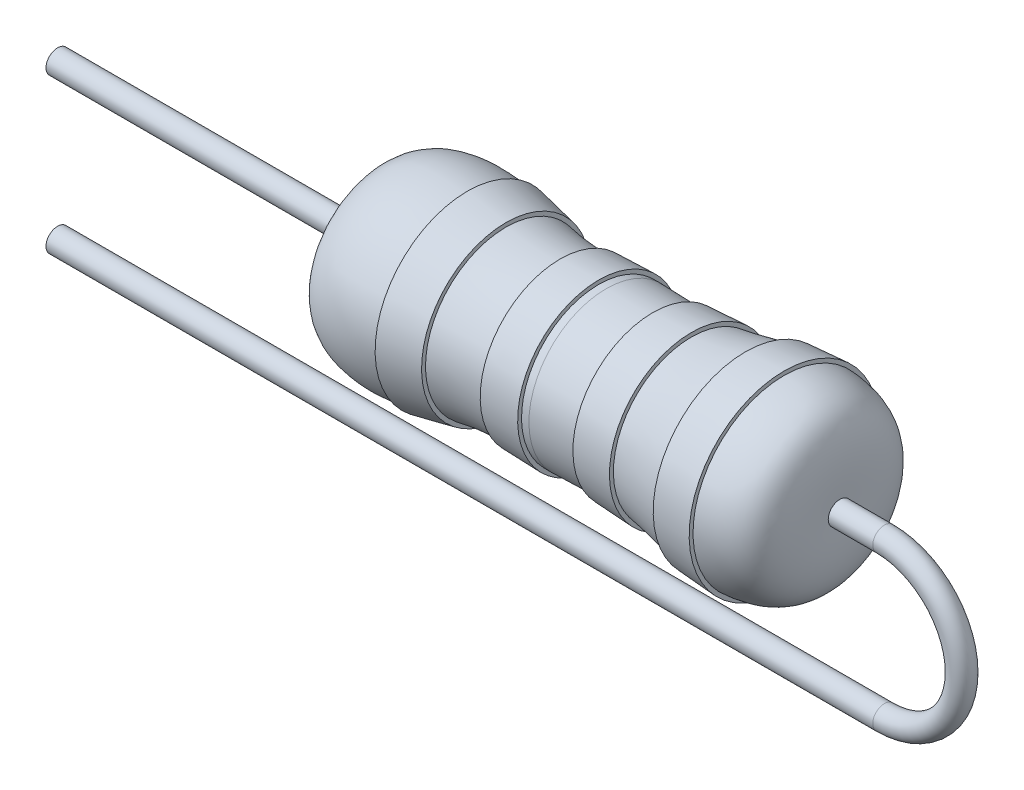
ISO-10303-21;
HEADER;
FILE_DESCRIPTION(('STEP AP214'),'2;1');
FILE_NAME('part.step','',(''),(''),'','','');
FILE_SCHEMA(('AUTOMOTIVE_DESIGN { 1 0 10303 214 1 1 1 1 }'));
ENDSEC;
DATA;
#1=APPLICATION_CONTEXT('core data for automotive mechanical design processes');
#2=APPLICATION_PROTOCOL_DEFINITION('international standard','automotive_design',2000,#1);
#3=PRODUCT_CONTEXT('',#1,'mechanical');
#4=PRODUCT('Part','Part','',(#3));
#5=PRODUCT_RELATED_PRODUCT_CATEGORY('part','',(#4));
#6=PRODUCT_DEFINITION_FORMATION('','',#4);
#7=PRODUCT_DEFINITION_CONTEXT('part definition',#1,'design');
#8=PRODUCT_DEFINITION('design','',#6,#7);
#9=PRODUCT_DEFINITION_SHAPE('','',#8);
#10=(LENGTH_UNIT() NAMED_UNIT(*) SI_UNIT(.MILLI.,.METRE.));
#11=(NAMED_UNIT(*) PLANE_ANGLE_UNIT() SI_UNIT($,.RADIAN.));
#12=(NAMED_UNIT(*) SI_UNIT($,.STERADIAN.) SOLID_ANGLE_UNIT());
#13=UNCERTAINTY_MEASURE_WITH_UNIT(LENGTH_MEASURE(1.E-05),#10,'distance_accuracy_value','');
#14=(GEOMETRIC_REPRESENTATION_CONTEXT(3) GLOBAL_UNCERTAINTY_ASSIGNED_CONTEXT((#13)) GLOBAL_UNIT_ASSIGNED_CONTEXT((#10,
#11,#12)) REPRESENTATION_CONTEXT('',''));
#15=CARTESIAN_POINT('',(0.,0.,0.));
#16=DIRECTION('',(0.,0.,1.));
#17=DIRECTION('',(1.,0.,0.));
#18=AXIS2_PLACEMENT_3D('',#15,#16,#17);
#19=CARTESIAN_POINT('',(-0.597354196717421,0.983703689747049,0.));
#20=CARTESIAN_POINT('',(-0.741393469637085,0.982379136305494,0.));
#21=CARTESIAN_POINT('',(-0.97114945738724,0.986743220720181,0.));
#22=CARTESIAN_POINT('',(-1.21027439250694,1.02468395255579,0.));
#23=CARTESIAN_POINT('',(-1.29735419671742,1.04115266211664,0.));
#24=B_SPLINE_CURVE_WITH_KNOTS('',3,(#19,#20,#21,#22,#23),.UNSPECIFIED.,.F.,.F.,(4,1,4),
(0.15485366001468,0.255892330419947,0.321578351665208),.UNSPECIFIED.);
#25=CARTESIAN_POINT('',(3.1,0.,0.));
#26=DIRECTION('',(1.,0.,0.));
#27=AXIS1_PLACEMENT('',#25,#26);
#28=SURFACE_OF_REVOLUTION('',#24,#27);
#29=CARTESIAN_POINT('',(-1.29735419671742,0.,0.));
#30=DIRECTION('',(1.,0.,0.));
#31=DIRECTION('',(0.,1.,0.));
#32=AXIS2_PLACEMENT_3D('',#29,#30,#31);
#33=CIRCLE('',#32,1.04115266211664);
#34=CARTESIAN_POINT('',(-1.29735419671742,1.04115266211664,0.));
#35=VERTEX_POINT('',#34);
#36=EDGE_CURVE('E10',#35,#35,#33,.T.);
#37=ORIENTED_EDGE('',*,*,#36,.T.);
#38=EDGE_LOOP('',(#37));
#39=FACE_BOUND('',#38,.T.);
#40=CARTESIAN_POINT('',(-0.597354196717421,0.,0.));
#41=DIRECTION('',(1.,0.,0.));
#42=DIRECTION('',(0.,1.,0.));
#43=AXIS2_PLACEMENT_3D('',#40,#41,#42);
#44=CIRCLE('',#43,0.98370368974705);
#45=CARTESIAN_POINT('',(-0.597354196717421,0.983703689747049,0.));
#46=VERTEX_POINT('',#45);
#47=EDGE_CURVE('E90',#46,#46,#44,.T.);
#48=ORIENTED_EDGE('',*,*,#47,.F.);
#49=EDGE_LOOP('',(#48));
#50=FACE_BOUND('',#49,.T.);
#51=ADVANCED_FACE('F28',(#39,#50),#28,.F.);
#52=CARTESIAN_POINT('',(-1.29735419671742,1.09232048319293,0.));
#53=DIRECTION('',(1.,0.,0.));
#54=DIRECTION('',(0.,1.,0.));
#55=AXIS2_PLACEMENT_3D('',#52,#53,#54);
#56=PLANE('',#55);
#57=CARTESIAN_POINT('',(-1.29735419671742,0.,0.));
#58=DIRECTION('',(1.,0.,0.));
#59=DIRECTION('',(0.,1.,0.));
#60=AXIS2_PLACEMENT_3D('',#57,#58,#59);
#61=CIRCLE('',#60,1.09232048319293);
#62=CARTESIAN_POINT('',(-1.29735419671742,1.09232048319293,0.));
#63=VERTEX_POINT('',#62);
#64=EDGE_CURVE('E35',#63,#63,#61,.T.);
#65=ORIENTED_EDGE('',*,*,#64,.T.);
#66=EDGE_LOOP('',(#65));
#67=FACE_BOUND('',#66,.T.);
#68=ORIENTED_EDGE('',*,*,#36,.F.);
#69=EDGE_LOOP('',(#68));
#70=FACE_BOUND('',#69,.T.);
#71=ADVANCED_FACE('F177',(#67,#70),#56,.T.);
#72=CARTESIAN_POINT('',(-1.29735419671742,0.,0.));
#73=DIRECTION('',(-1.,0.,0.));
#74=DIRECTION('',(0.,-1.,0.));
#75=AXIS2_PLACEMENT_3D('',#72,#73,#74);
#76=CONICAL_SURFACE('',#75,1.09232048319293,0.199712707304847);
#77=CARTESIAN_POINT('',(-1.79735419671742,0.,0.));
#78=DIRECTION('',(1.,0.,0.));
#79=DIRECTION('',(0.,1.,0.));
#80=AXIS2_PLACEMENT_3D('',#77,#78,#79);
#81=CIRCLE('',#80,1.1935259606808);
#82=CARTESIAN_POINT('',(-1.79735419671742,1.1935259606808,0.));
#83=VERTEX_POINT('',#82);
#84=EDGE_CURVE('E39',#83,#83,#81,.T.);
#85=ORIENTED_EDGE('',*,*,#84,.T.);
#86=EDGE_LOOP('',(#85));
#87=FACE_BOUND('',#86,.T.);
#88=ORIENTED_EDGE('',*,*,#64,.F.);
#89=EDGE_LOOP('',(#88));
#90=FACE_BOUND('',#89,.T.);
#91=ADVANCED_FACE('F174',(#87,#90),#76,.T.);
#92=CARTESIAN_POINT('',(-1.79735419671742,1.1935259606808,0.));
#93=DIRECTION('',(-1.,0.,0.));
#94=DIRECTION('',(0.,-1.,0.));
#95=AXIS2_PLACEMENT_3D('',#92,#93,#94);
#96=PLANE('',#95);
#97=CARTESIAN_POINT('',(-1.79735419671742,0.,0.));
#98=DIRECTION('',(1.,0.,0.));
#99=DIRECTION('',(0.,1.,0.));
#100=AXIS2_PLACEMENT_3D('',#97,#98,#99);
#101=CIRCLE('',#100,1.14275704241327);
#102=CARTESIAN_POINT('',(-1.79735419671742,1.14275704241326,0.));
#103=VERTEX_POINT('',#102);
#104=EDGE_CURVE('E43',#103,#103,#101,.T.);
#105=ORIENTED_EDGE('',*,*,#104,.T.);
#106=EDGE_LOOP('',(#105));
#107=FACE_BOUND('',#106,.T.);
#108=ORIENTED_EDGE('',*,*,#84,.F.);
#109=EDGE_LOOP('',(#108));
#110=FACE_BOUND('',#109,.T.);
#111=ADVANCED_FACE('F170',(#107,#110),#96,.T.);
#112=CARTESIAN_POINT('',(-1.79735419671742,1.14275704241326,0.));
#113=CARTESIAN_POINT('',(-1.96068782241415,1.17145675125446,0.));
#114=CARTESIAN_POINT('',(-2.31177453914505,1.20993253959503,0.));
#115=CARTESIAN_POINT('',(-3.04069848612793,1.04626137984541,0.));
#116=CARTESIAN_POINT('',(-3.0390580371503,0.470476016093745,0.));
#117=CARTESIAN_POINT('',(-3.02359149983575,0.15,0.));
#118=B_SPLINE_CURVE_WITH_KNOTS('',3,(#112,#113,#114,#115,#116,#117),.UNSPECIFIED.,.F.,.F.,(4,1,
1,4),(0.449746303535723,0.575550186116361,0.717128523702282,0.932875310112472),.UNSPECIFIED.);
#119=CARTESIAN_POINT('',(3.1,0.,0.));
#120=DIRECTION('',(1.,0.,0.));
#121=AXIS1_PLACEMENT('',#119,#120);
#122=SURFACE_OF_REVOLUTION('',#118,#121);
#123=CARTESIAN_POINT('',(-3.02359149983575,0.,0.));
#124=DIRECTION('',(1.,0.,0.));
#125=DIRECTION('',(0.,1.,0.));
#126=AXIS2_PLACEMENT_3D('',#123,#124,#125);
#127=CIRCLE('',#126,0.150000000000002);
#128=CARTESIAN_POINT('',(-3.02359149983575,0.15,0.));
#129=VERTEX_POINT('',#128);
#130=EDGE_CURVE('E48',#129,#129,#127,.T.);
#131=ORIENTED_EDGE('',*,*,#130,.T.);
#132=EDGE_LOOP('',(#131));
#133=FACE_BOUND('',#132,.T.);
#134=ORIENTED_EDGE('',*,*,#104,.F.);
#135=EDGE_LOOP('',(#134));
#136=FACE_BOUND('',#135,.T.);
#137=ADVANCED_FACE('F166',(#133,#136),#122,.F.);
#138=CARTESIAN_POINT('',(3.1,0.,0.));
#139=DIRECTION('',(1.,0.,0.));
#140=DIRECTION('',(0.,1.,0.));
#141=AXIS2_PLACEMENT_3D('',#138,#139,#140);
#142=CYLINDRICAL_SURFACE('',#141,0.150000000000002);
#143=ORIENTED_EDGE('',*,*,#130,.F.);
#144=EDGE_LOOP('',(#143));
#145=FACE_BOUND('',#144,.T.);
#146=CARTESIAN_POINT('',(-7.1,0.,0.));
#147=DIRECTION('',(-1.,0.,0.));
#148=DIRECTION('',(0.,-1.,0.));
#149=AXIS2_PLACEMENT_3D('',#146,#147,#148);
#150=CIRCLE('',#149,0.150000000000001);
#151=CARTESIAN_POINT('',(-7.1,-0.150000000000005,0.));
#152=VERTEX_POINT('',#151);
#153=EDGE_CURVE('E237',#152,#152,#150,.T.);
#154=ORIENTED_EDGE('',*,*,#153,.F.);
#155=EDGE_LOOP('',(#154));
#156=FACE_BOUND('',#155,.T.);
#157=ADVANCED_FACE('F162',(#145,#156),#142,.T.);
#158=CARTESIAN_POINT('',(3.1,0.,0.));
#159=DIRECTION('',(1.,0.,0.));
#160=DIRECTION('',(0.,1.,0.));
#161=AXIS2_PLACEMENT_3D('',#158,#159,#160);
#162=CYLINDRICAL_SURFACE('',#161,0.15);
#163=CARTESIAN_POINT('',(3.02359150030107,0.,0.));
#164=DIRECTION('',(1.,0.,0.));
#165=DIRECTION('',(0.,1.,0.));
#166=AXIS2_PLACEMENT_3D('',#163,#164,#165);
#167=CIRCLE('',#166,0.15);
#168=CARTESIAN_POINT('',(3.02359150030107,0.15,0.));
#169=VERTEX_POINT('',#168);
#170=EDGE_CURVE('E51',#169,#169,#167,.T.);
#171=ORIENTED_EDGE('',*,*,#170,.T.);
#172=EDGE_LOOP('',(#171));
#173=FACE_BOUND('',#172,.T.);
#174=CARTESIAN_POINT('',(3.6,0.,0.));
#175=DIRECTION('',(1.,0.,0.));
#176=DIRECTION('',(0.,0.,-1.));
#177=AXIS2_PLACEMENT_3D('',#174,#175,#176);
#178=CIRCLE('',#177,0.15);
#179=CARTESIAN_POINT('',(3.6,0.15,0.));
#180=VERTEX_POINT('',#179);
#181=EDGE_CURVE('E234',#180,#180,#178,.T.);
#182=ORIENTED_EDGE('',*,*,#181,.F.);
#183=EDGE_LOOP('',(#182));
#184=FACE_BOUND('',#183,.T.);
#185=ADVANCED_FACE('F158',(#173,#184),#162,.T.);
#186=CARTESIAN_POINT('',(3.02359150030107,0.15,0.));
#187=CARTESIAN_POINT('',(3.03906853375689,0.470693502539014,0.));
#188=CARTESIAN_POINT('',(3.04040701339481,1.04615882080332,0.));
#189=CARTESIAN_POINT('',(2.50195996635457,1.16735450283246,0.));
#190=CARTESIAN_POINT('',(2.30264580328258,1.17909283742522,0.));
#191=B_SPLINE_CURVE_WITH_KNOTS('',3,(#186,#187,#188,#189,#190),.UNSPECIFIED.,.F.,.F.,(4,1,4),
(0.575307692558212,0.791200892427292,0.932875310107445),.UNSPECIFIED.);
#192=CARTESIAN_POINT('',(3.1,0.,0.));
#193=DIRECTION('',(1.,0.,0.));
#194=AXIS1_PLACEMENT('',#192,#193);
#195=SURFACE_OF_REVOLUTION('',#191,#194);
#196=CARTESIAN_POINT('',(2.30264580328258,0.,0.));
#197=DIRECTION('',(1.,0.,0.));
#198=DIRECTION('',(0.,1.,0.));
#199=AXIS2_PLACEMENT_3D('',#196,#197,#198);
#200=CIRCLE('',#199,1.17909283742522);
#201=CARTESIAN_POINT('',(2.30264580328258,1.17909283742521,0.));
#202=VERTEX_POINT('',#201);
#203=EDGE_CURVE('E54',#202,#202,#200,.T.);
#204=ORIENTED_EDGE('',*,*,#203,.T.);
#205=EDGE_LOOP('',(#204));
#206=FACE_BOUND('',#205,.T.);
#207=ORIENTED_EDGE('',*,*,#170,.F.);
#208=EDGE_LOOP('',(#207));
#209=FACE_BOUND('',#208,.T.);
#210=ADVANCED_FACE('F153',(#206,#209),#195,.F.);
#211=CARTESIAN_POINT('',(2.30264580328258,1.17909283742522,0.));
#212=DIRECTION('',(1.,0.,0.));
#213=DIRECTION('',(0.,1.,0.));
#214=AXIS2_PLACEMENT_3D('',#211,#212,#213);
#215=PLANE('',#214);
#216=CARTESIAN_POINT('',(2.30264580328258,0.,0.));
#217=DIRECTION('',(1.,0.,0.));
#218=DIRECTION('',(0.,1.,0.));
#219=AXIS2_PLACEMENT_3D('',#216,#217,#218);
#220=CIRCLE('',#219,1.22914772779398);
#221=CARTESIAN_POINT('',(2.30264580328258,1.22914772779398,0.));
#222=VERTEX_POINT('',#221);
#223=EDGE_CURVE('E57',#222,#222,#220,.T.);
#224=ORIENTED_EDGE('',*,*,#223,.T.);
#225=EDGE_LOOP('',(#224));
#226=FACE_BOUND('',#225,.T.);
#227=ORIENTED_EDGE('',*,*,#203,.F.);
#228=EDGE_LOOP('',(#227));
#229=FACE_BOUND('',#228,.T.);
#230=ADVANCED_FACE('F157',(#226,#229),#215,.T.);
#231=CARTESIAN_POINT('',(2.30264580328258,0.,0.));
#232=DIRECTION('',(1.,0.,0.));
#233=DIRECTION('',(0.,1.,0.));
#234=AXIS2_PLACEMENT_3D('',#231,#232,#233);
#235=CONICAL_SURFACE('',#234,1.22914772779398,0.0693079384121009);
#236=CARTESIAN_POINT('',(1.80264580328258,0.,0.));
#237=DIRECTION('',(1.,0.,0.));
#238=DIRECTION('',(0.,1.,0.));
#239=AXIS2_PLACEMENT_3D('',#236,#237,#238);
#240=CIRCLE('',#239,1.19443816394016);
#241=CARTESIAN_POINT('',(1.80264580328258,1.19443816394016,0.));
#242=VERTEX_POINT('',#241);
#243=EDGE_CURVE('E60',#242,#242,#240,.T.);
#244=ORIENTED_EDGE('',*,*,#243,.T.);
#245=EDGE_LOOP('',(#244));
#246=FACE_BOUND('',#245,.T.);
#247=ORIENTED_EDGE('',*,*,#223,.F.);
#248=EDGE_LOOP('',(#247));
#249=FACE_BOUND('',#248,.T.);
#250=ADVANCED_FACE('F219',(#246,#249),#235,.T.);
#251=CARTESIAN_POINT('',(1.80264580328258,1.19443816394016,0.));
#252=DIRECTION('',(-1.,0.,0.));
#253=DIRECTION('',(0.,-1.,0.));
#254=AXIS2_PLACEMENT_3D('',#251,#252,#253);
#255=PLANE('',#254);
#256=CARTESIAN_POINT('',(1.80264580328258,0.,0.));
#257=DIRECTION('',(1.,0.,0.));
#258=DIRECTION('',(0.,1.,0.));
#259=AXIS2_PLACEMENT_3D('',#256,#257,#258);
#260=CIRCLE('',#259,1.14368296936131);
#261=CARTESIAN_POINT('',(1.80264580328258,1.14368296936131,0.));
#262=VERTEX_POINT('',#261);
#263=EDGE_CURVE('E63',#262,#262,#260,.T.);
#264=ORIENTED_EDGE('',*,*,#263,.T.);
#265=EDGE_LOOP('',(#264));
#266=FACE_BOUND('',#265,.T.);
#267=ORIENTED_EDGE('',*,*,#243,.F.);
#268=EDGE_LOOP('',(#267));
#269=FACE_BOUND('',#268,.T.);
#270=ADVANCED_FACE('F132',(#266,#269),#255,.T.);
#271=CARTESIAN_POINT('',(1.80264580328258,1.14368296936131,0.));
#272=CARTESIAN_POINT('',(1.57185221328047,1.10347001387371,0.));
#273=CARTESIAN_POINT('',(1.34646533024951,1.0417378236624,0.));
#274=CARTESIAN_POINT('',(1.10264580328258,1.0093635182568,0.));
#275=B_SPLINE_CURVE_WITH_KNOTS('',3,(#271,#272,#273,#274),.UNSPECIFIED.,.F.,.F.,(4,4),
(0.273403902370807,0.451104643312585),.UNSPECIFIED.);
#276=CARTESIAN_POINT('',(3.1,0.,0.));
#277=DIRECTION('',(1.,0.,0.));
#278=AXIS1_PLACEMENT('',#276,#277);
#279=SURFACE_OF_REVOLUTION('',#275,#278);
#280=CARTESIAN_POINT('',(1.10264580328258,0.,0.));
#281=DIRECTION('',(1.,0.,0.));
#282=DIRECTION('',(0.,1.,0.));
#283=AXIS2_PLACEMENT_3D('',#280,#281,#282);
#284=CIRCLE('',#283,1.0093635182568);
#285=CARTESIAN_POINT('',(1.10264580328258,1.0093635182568,0.));
#286=VERTEX_POINT('',#285);
#287=EDGE_CURVE('E66',#286,#286,#284,.T.);
#288=ORIENTED_EDGE('',*,*,#287,.T.);
#289=EDGE_LOOP('',(#288));
#290=FACE_BOUND('',#289,.T.);
#291=ORIENTED_EDGE('',*,*,#263,.F.);
#292=EDGE_LOOP('',(#291));
#293=FACE_BOUND('',#292,.T.);
#294=ADVANCED_FACE('F128',(#290,#293),#279,.F.);
#295=CARTESIAN_POINT('',(1.10264580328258,1.0605778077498,0.));
#296=DIRECTION('',(1.,0.,0.));
#297=DIRECTION('',(0.,1.,0.));
#298=AXIS2_PLACEMENT_3D('',#295,#296,#297);
#299=PLANE('',#298);
#300=CARTESIAN_POINT('',(1.10264580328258,0.,0.));
#301=DIRECTION('',(1.,0.,0.));
#302=DIRECTION('',(0.,1.,0.));
#303=AXIS2_PLACEMENT_3D('',#300,#301,#302);
#304=CIRCLE('',#303,1.0605778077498);
#305=CARTESIAN_POINT('',(1.10264580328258,1.0605778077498,0.));
#306=VERTEX_POINT('',#305);
#307=EDGE_CURVE('E69',#306,#306,#304,.T.);
#308=ORIENTED_EDGE('',*,*,#307,.T.);
#309=EDGE_LOOP('',(#308));
#310=FACE_BOUND('',#309,.T.);
#311=ORIENTED_EDGE('',*,*,#287,.F.);
#312=EDGE_LOOP('',(#311));
#313=FACE_BOUND('',#312,.T.);
#314=ADVANCED_FACE('F124',(#310,#313),#299,.T.);
#315=CARTESIAN_POINT('',(1.10264580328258,0.,0.));
#316=DIRECTION('',(1.,0.,0.));
#317=DIRECTION('',(0.,1.,0.));
#318=AXIS2_PLACEMENT_3D('',#315,#316,#317);
#319=CONICAL_SURFACE('',#318,1.0605778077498,0.054415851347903);
#320=CARTESIAN_POINT('',(0.60264580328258,0.,0.));
#321=DIRECTION('',(1.,0.,0.));
#322=DIRECTION('',(0.,1.,0.));
#323=AXIS2_PLACEMENT_3D('',#320,#321,#322);
#324=CIRCLE('',#323,1.03334299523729);
#325=CARTESIAN_POINT('',(0.602645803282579,1.03334299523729,0.));
#326=VERTEX_POINT('',#325);
#327=EDGE_CURVE('E72',#326,#326,#324,.T.);
#328=ORIENTED_EDGE('',*,*,#327,.T.);
#329=EDGE_LOOP('',(#328));
#330=FACE_BOUND('',#329,.T.);
#331=ORIENTED_EDGE('',*,*,#307,.F.);
#332=EDGE_LOOP('',(#331));
#333=FACE_BOUND('',#332,.T.);
#334=ADVANCED_FACE('F120',(#330,#333),#319,.T.);
#335=CARTESIAN_POINT('',(0.602645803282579,1.03334299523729,0.));
#336=DIRECTION('',(-1.,0.,0.));
#337=DIRECTION('',(0.,-1.,0.));
#338=AXIS2_PLACEMENT_3D('',#335,#336,#337);
#339=PLANE('',#338);
#340=CARTESIAN_POINT('',(0.60264580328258,0.,0.));
#341=DIRECTION('',(1.,0.,0.));
#342=DIRECTION('',(0.,1.,0.));
#343=AXIS2_PLACEMENT_3D('',#340,#341,#342);
#344=CIRCLE('',#343,0.983657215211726);
#345=CARTESIAN_POINT('',(0.602645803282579,0.983657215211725,0.));
#346=VERTEX_POINT('',#345);
#347=EDGE_CURVE('E75',#346,#346,#344,.T.);
#348=ORIENTED_EDGE('',*,*,#347,.T.);
#349=EDGE_LOOP('',(#348));
#350=FACE_BOUND('',#349,.T.);
#351=ORIENTED_EDGE('',*,*,#327,.F.);
#352=EDGE_LOOP('',(#351));
#353=FACE_BOUND('',#352,.T.);
#354=ADVANCED_FACE('F116',(#350,#353),#339,.T.);
#355=CARTESIAN_POINT('',(0.602645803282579,0.983657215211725,0.));
#356=CARTESIAN_POINT('',(0.379986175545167,0.985520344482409,0.));
#357=CARTESIAN_POINT('',(0.165951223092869,0.999033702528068,0.));
#358=CARTESIAN_POINT('',(0.,1.,0.));
#359=B_SPLINE_CURVE_WITH_KNOTS('',3,(#355,#356,#357,#358),.UNSPECIFIED.,.F.,.F.,(4,4),(0.,
0.156090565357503),.UNSPECIFIED.);
#360=CARTESIAN_POINT('',(3.1,0.,0.));
#361=DIRECTION('',(1.,0.,0.));
#362=AXIS1_PLACEMENT('',#360,#361);
#363=SURFACE_OF_REVOLUTION('',#359,#362);
#364=CARTESIAN_POINT('',(0.,0.,0.));
#365=DIRECTION('',(1.,0.,0.));
#366=DIRECTION('',(0.,1.,0.));
#367=AXIS2_PLACEMENT_3D('',#364,#365,#366);
#368=CIRCLE('',#367,1.);
#369=CARTESIAN_POINT('',(0.,1.,0.));
#370=VERTEX_POINT('',#369);
#371=EDGE_CURVE('E78',#370,#370,#368,.T.);
#372=ORIENTED_EDGE('',*,*,#371,.T.);
#373=EDGE_LOOP('',(#372));
#374=FACE_BOUND('',#373,.T.);
#375=ORIENTED_EDGE('',*,*,#347,.F.);
#376=EDGE_LOOP('',(#375));
#377=FACE_BOUND('',#376,.T.);
#378=ADVANCED_FACE('F111',(#374,#377),#363,.F.);
#379=CARTESIAN_POINT('',(0.,1.,0.));
#380=CARTESIAN_POINT('',(-0.0308720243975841,0.99982023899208,0.));
#381=CARTESIAN_POINT('',(-0.0634081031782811,0.99920625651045,0.));
#382=CARTESIAN_POINT('',(-0.0973541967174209,0.998313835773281,0.));
#383=B_SPLINE_CURVE_WITH_KNOTS('',3,(#379,#380,#381,#382),.UNSPECIFIED.,.F.,.F.,(4,4),(0.,
0.0290376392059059),.UNSPECIFIED.);
#384=CARTESIAN_POINT('',(3.1,0.,0.));
#385=DIRECTION('',(1.,0.,0.));
#386=AXIS1_PLACEMENT('',#384,#385);
#387=SURFACE_OF_REVOLUTION('',#383,#386);
#388=CARTESIAN_POINT('',(-0.0973541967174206,0.,0.));
#389=DIRECTION('',(1.,0.,0.));
#390=DIRECTION('',(0.,1.,0.));
#391=AXIS2_PLACEMENT_3D('',#388,#389,#390);
#392=CIRCLE('',#391,0.998313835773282);
#393=CARTESIAN_POINT('',(-0.097354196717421,0.998313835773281,0.));
#394=VERTEX_POINT('',#393);
#395=EDGE_CURVE('E81',#394,#394,#392,.T.);
#396=ORIENTED_EDGE('',*,*,#395,.T.);
#397=EDGE_LOOP('',(#396));
#398=FACE_BOUND('',#397,.T.);
#399=ORIENTED_EDGE('',*,*,#371,.F.);
#400=EDGE_LOOP('',(#399));
#401=FACE_BOUND('',#400,.T.);
#402=ADVANCED_FACE('F106',(#398,#401),#387,.F.);
#403=CARTESIAN_POINT('',(-0.0973541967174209,1.04852779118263,0.));
#404=DIRECTION('',(1.,0.,0.));
#405=DIRECTION('',(0.,1.,0.));
#406=AXIS2_PLACEMENT_3D('',#403,#404,#405);
#407=PLANE('',#406);
#408=CARTESIAN_POINT('',(-0.0973541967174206,0.,0.));
#409=DIRECTION('',(1.,0.,0.));
#410=DIRECTION('',(0.,1.,0.));
#411=AXIS2_PLACEMENT_3D('',#408,#409,#410);
#412=CIRCLE('',#411,1.04852779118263);
#413=CARTESIAN_POINT('',(-0.097354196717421,1.04852779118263,0.));
#414=VERTEX_POINT('',#413);
#415=EDGE_CURVE('E84',#414,#414,#412,.T.);
#416=ORIENTED_EDGE('',*,*,#415,.T.);
#417=EDGE_LOOP('',(#416));
#418=FACE_BOUND('',#417,.T.);
#419=ORIENTED_EDGE('',*,*,#395,.F.);
#420=EDGE_LOOP('',(#419));
#421=FACE_BOUND('',#420,.T.);
#422=ADVANCED_FACE('F110',(#418,#421),#407,.T.);
#423=CARTESIAN_POINT('',(-0.0973541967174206,0.,0.));
#424=DIRECTION('',(1.,0.,0.));
#425=DIRECTION('',(0.,1.,0.));
#426=AXIS2_PLACEMENT_3D('',#423,#424,#425);
#427=CONICAL_SURFACE('',#426,1.04852779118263,0.0302525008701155);
#428=CARTESIAN_POINT('',(-0.597354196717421,0.,0.));
#429=DIRECTION('',(1.,0.,0.));
#430=DIRECTION('',(0.,1.,0.));
#431=AXIS2_PLACEMENT_3D('',#428,#429,#430);
#432=CIRCLE('',#431,1.03339692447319);
#433=CARTESIAN_POINT('',(-0.597354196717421,1.03339692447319,0.));
#434=VERTEX_POINT('',#433);
#435=EDGE_CURVE('E87',#434,#434,#432,.T.);
#436=ORIENTED_EDGE('',*,*,#435,.T.);
#437=EDGE_LOOP('',(#436));
#438=FACE_BOUND('',#437,.T.);
#439=ORIENTED_EDGE('',*,*,#415,.F.);
#440=EDGE_LOOP('',(#439));
#441=FACE_BOUND('',#440,.T.);
#442=ADVANCED_FACE('F193',(#438,#441),#427,.T.);
#443=CARTESIAN_POINT('',(-0.597354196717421,1.03339692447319,0.));
#444=DIRECTION('',(-1.,0.,0.));
#445=DIRECTION('',(0.,-1.,0.));
#446=AXIS2_PLACEMENT_3D('',#443,#444,#445);
#447=PLANE('',#446);
#448=ORIENTED_EDGE('',*,*,#47,.T.);
#449=EDGE_LOOP('',(#448));
#450=FACE_BOUND('',#449,.T.);
#451=ORIENTED_EDGE('',*,*,#435,.F.);
#452=EDGE_LOOP('',(#451));
#453=FACE_BOUND('',#452,.T.);
#454=ADVANCED_FACE('F189',(#450,#453),#447,.T.);
#455=CARTESIAN_POINT('',(3.6,-2.,0.));
#456=DIRECTION('',(-1.,0.,0.));
#457=DIRECTION('',(0.,-1.,0.));
#458=AXIS2_PLACEMENT_3D('',#455,#456,#457);
#459=CYLINDRICAL_SURFACE('',#458,0.15);
#460=CARTESIAN_POINT('',(3.6,-2.,0.));
#461=DIRECTION('',(-1.,0.,0.));
#462=DIRECTION('',(0.,0.,-1.));
#463=AXIS2_PLACEMENT_3D('',#460,#461,#462);
#464=CIRCLE('',#463,0.15);
#465=CARTESIAN_POINT('',(3.6,-2.15,0.));
#466=VERTEX_POINT('',#465);
#467=EDGE_CURVE('E236',#466,#466,#464,.T.);
#468=ORIENTED_EDGE('',*,*,#467,.T.);
#469=EDGE_LOOP('',(#468));
#470=FACE_BOUND('',#469,.T.);
#471=CARTESIAN_POINT('',(-7.1,-2.,0.));
#472=DIRECTION('',(-1.,0.,0.));
#473=DIRECTION('',(0.,0.,-1.));
#474=AXIS2_PLACEMENT_3D('',#471,#472,#473);
#475=CIRCLE('',#474,0.15);
#476=CARTESIAN_POINT('',(-7.1,-2.,-0.15));
#477=VERTEX_POINT('',#476);
#478=EDGE_CURVE('E93',#477,#477,#475,.T.);
#479=ORIENTED_EDGE('',*,*,#478,.F.);
#480=EDGE_LOOP('',(#479));
#481=FACE_BOUND('',#480,.T.);
#482=ADVANCED_FACE('F192',(#470,#481),#459,.T.);
#483=CARTESIAN_POINT('',(3.6,-1.,0.));
#484=DIRECTION('',(0.,0.,-1.));
#485=DIRECTION('',(-1.,0.,0.));
#486=AXIS2_PLACEMENT_3D('',#483,#484,#485);
#487=TOROIDAL_SURFACE('',#486,1.,0.15);
#488=CARTESIAN_POINT('',(3.6,-1.,0.));
#489=DIRECTION('',(0.,0.,-1.));
#490=DIRECTION('',(-1.,0.,0.));
#491=AXIS2_PLACEMENT_3D('',#488,#489,#490);
#492=CIRCLE('',#491,1.15);
#493=EDGE_CURVE('',#180,#466,#492,.T.);
#494=ORIENTED_EDGE('',*,*,#181,.T.);
#495=ORIENTED_EDGE('',*,*,#467,.F.);
#496=ORIENTED_EDGE('',*,*,#493,.T.);
#497=ORIENTED_EDGE('',*,*,#493,.F.);
#498=EDGE_LOOP('',(#494,#496,#495,#497));
#499=FACE_BOUND('',#498,.T.);
#500=ADVANCED_FACE('F256',(#499),#487,.T.);
#501=CARTESIAN_POINT('',(-7.1,-2.,0.));
#502=DIRECTION('',(-1.,0.,0.));
#503=DIRECTION('',(0.,0.,-1.));
#504=AXIS2_PLACEMENT_3D('',#501,#502,#503);
#505=PLANE('',#504);
#506=ORIENTED_EDGE('',*,*,#478,.T.);
#507=EDGE_LOOP('',(#506));
#508=FACE_BOUND('',#507,.T.);
#509=ADVANCED_FACE('F253',(#508),#505,.T.);
#510=CARTESIAN_POINT('',(-7.1,0.,0.));
#511=DIRECTION('',(-1.,0.,0.));
#512=DIRECTION('',(0.,-1.,0.));
#513=AXIS2_PLACEMENT_3D('',#510,#511,#512);
#514=PLANE('',#513);
#515=ORIENTED_EDGE('',*,*,#153,.T.);
#516=EDGE_LOOP('',(#515));
#517=FACE_BOUND('',#516,.T.);
#518=ADVANCED_FACE('F266',(#517),#514,.T.);
#519=CLOSED_SHELL('',(#51,#71,#91,#111,#137,#157,#185,#210,#230,#250,#270,#294,#314,#334,#354,
#378,#402,#422,#442,#454,#482,#500,#509,#518));
#520=MANIFOLD_SOLID_BREP('B2',#519);
#521=ADVANCED_BREP_SHAPE_REPRESENTATION('',(#18,#520),#14);
#522=SHAPE_DEFINITION_REPRESENTATION(#9,#521);
ENDSEC;
END-ISO-10303-21;
